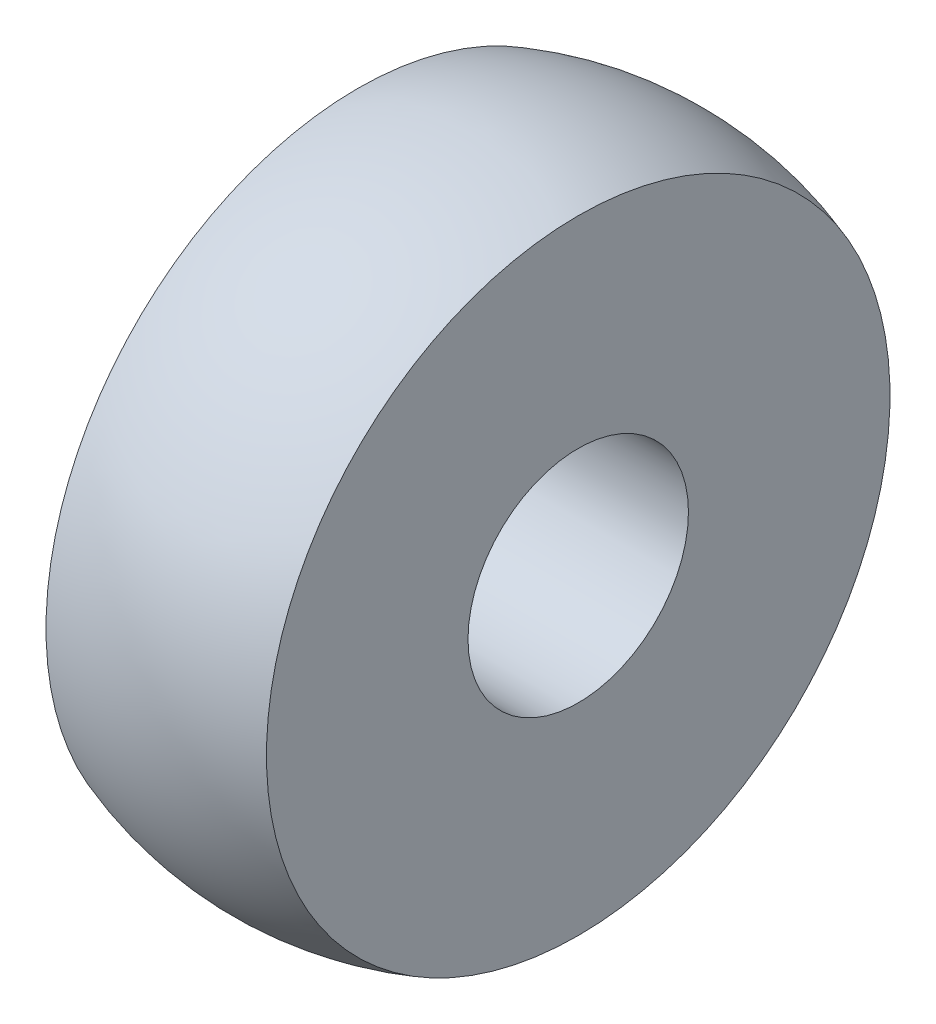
from build123d import *


with BuildPart() as part:
    # Sketch1 → Base-Revolve (revolve)
    with BuildSketch(Plane.XY):
        with BuildLine():
            Line((-6.35, 6.35), (6.35, 6.35))
            Line((6.35, 6.35), (6.35, 17.960512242))
            ThreePointArc((6.35, 17.960512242), (0, 19.05), (-6.35, 17.960512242))
            Line((-6.35, 17.960512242), (-6.35, 6.35))
        make_face()
    revolve(axis=Axis((-11.472038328, 0, 0), (1, 0, 0)))


solid = part.part
